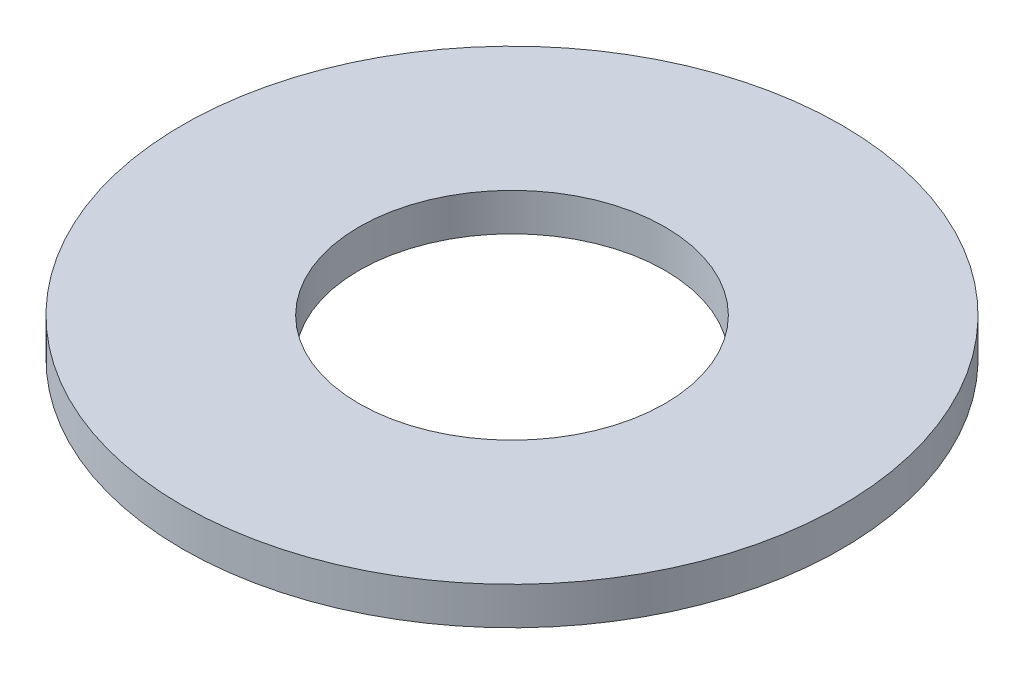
from build123d import *

# Parameters (mm, degrees)
SKETCH1_R      = 11.1125
SKETCH1_R_2    = 5.159375
EXTRUDE1_DEPTH = 1.27


with BuildPart() as part:
    # Sketch1 → Extrude1 (new body)
    with BuildSketch(Plane(origin=(0, 0, 0), x_dir=(1, 0, 0), z_dir=(0, 1, 0))):
        with Locations(Location((0, 0, 0), (0, 0, 270))):
            Circle(SKETCH1_R)
        with Locations(Location((0, 0, 0), (0, 0, 270))):
            Circle(SKETCH1_R_2, mode=Mode.SUBTRACT)
    extrude(amount=EXTRUDE1_DEPTH)


solid = part.part
